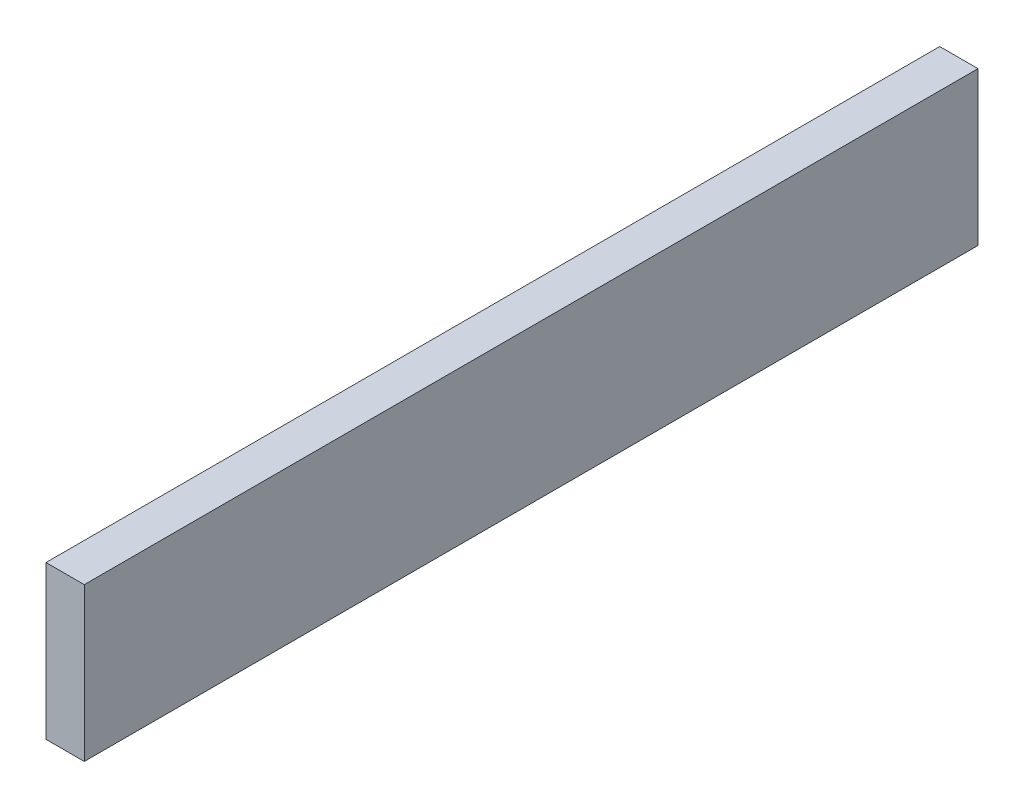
from build123d import *

# Parameters (mm, degrees)
SKETCH1_W           = 25.4
SKETCH1_H           = 101.6
BOSS_EXTRUDE1_DEPTH = 592.836


with BuildPart() as part:
    # Sketch1 → Boss-Extrude1 (new body)
    with BuildSketch(Plane.XY):
        Rectangle(SKETCH1_W, SKETCH1_H)
    extrude(amount=BOSS_EXTRUDE1_DEPTH)


solid = part.part
